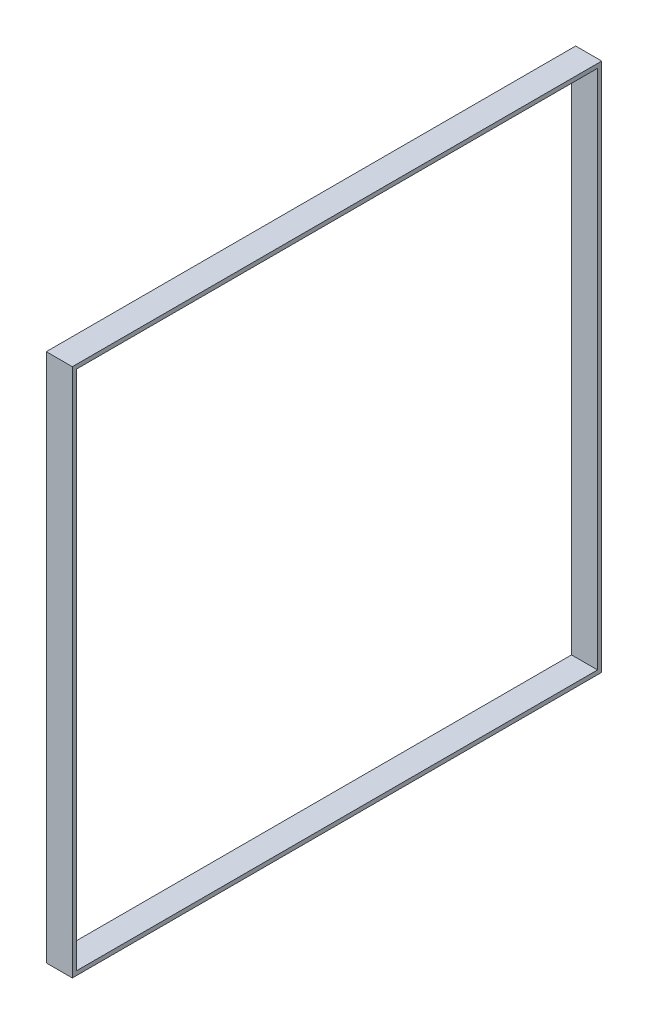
ISO-10303-21;
HEADER;
FILE_DESCRIPTION(('STEP AP214'),'2;1');
FILE_NAME('part.step','',(''),(''),'','','');
FILE_SCHEMA(('AUTOMOTIVE_DESIGN { 1 0 10303 214 1 1 1 1 }'));
ENDSEC;
DATA;
#1=APPLICATION_CONTEXT('core data for automotive mechanical design processes');
#2=APPLICATION_PROTOCOL_DEFINITION('international standard','automotive_design',2000,#1);
#3=PRODUCT_CONTEXT('',#1,'mechanical');
#4=PRODUCT('Part','Part','',(#3));
#5=PRODUCT_RELATED_PRODUCT_CATEGORY('part','',(#4));
#6=PRODUCT_DEFINITION_FORMATION('','',#4);
#7=PRODUCT_DEFINITION_CONTEXT('part definition',#1,'design');
#8=PRODUCT_DEFINITION('design','',#6,#7);
#9=PRODUCT_DEFINITION_SHAPE('','',#8);
#10=(LENGTH_UNIT() NAMED_UNIT(*) SI_UNIT(.MILLI.,.METRE.));
#11=(NAMED_UNIT(*) PLANE_ANGLE_UNIT() SI_UNIT($,.RADIAN.));
#12=(NAMED_UNIT(*) SI_UNIT($,.STERADIAN.) SOLID_ANGLE_UNIT());
#13=UNCERTAINTY_MEASURE_WITH_UNIT(LENGTH_MEASURE(1.E-05),#10,'distance_accuracy_value','');
#14=(GEOMETRIC_REPRESENTATION_CONTEXT(3) GLOBAL_UNCERTAINTY_ASSIGNED_CONTEXT((#13)) GLOBAL_UNIT_ASSIGNED_CONTEXT((#10,
#11,#12)) REPRESENTATION_CONTEXT('',''));
#15=CARTESIAN_POINT('',(0.,0.,0.));
#16=DIRECTION('',(0.,0.,1.));
#17=DIRECTION('',(1.,0.,0.));
#18=AXIS2_PLACEMENT_3D('',#15,#16,#17);
#19=CARTESIAN_POINT('',(15.,0.,0.));
#20=DIRECTION('',(1.,0.,0.));
#21=DIRECTION('',(0.,0.,-1.));
#22=AXIS2_PLACEMENT_3D('',#19,#20,#21);
#23=PLANE('',#22);
#24=DIRECTION('',(0.,0.,-1.));
#25=VECTOR('',#24,1.);
#26=CARTESIAN_POINT('',(15.,-152.4,152.4));
#27=LINE('',#26,#25);
#28=CARTESIAN_POINT('',(15.,-152.4,152.4));
#29=VERTEX_POINT('',#28);
#30=CARTESIAN_POINT('',(15.,-152.4,-152.4));
#31=VERTEX_POINT('',#30);
#32=EDGE_CURVE('E156',#29,#31,#27,.T.);
#33=ORIENTED_EDGE('',*,*,#32,.T.);
#34=DIRECTION('',(0.,1.,0.));
#35=VECTOR('',#34,1.);
#36=CARTESIAN_POINT('',(15.,-152.4,-152.4));
#37=LINE('',#36,#35);
#38=CARTESIAN_POINT('',(15.,152.4,-152.4));
#39=VERTEX_POINT('',#38);
#40=EDGE_CURVE('E164',#31,#39,#37,.T.);
#41=ORIENTED_EDGE('',*,*,#40,.T.);
#42=DIRECTION('',(0.,0.,1.));
#43=VECTOR('',#42,1.);
#44=CARTESIAN_POINT('',(15.,152.4,-152.4));
#45=LINE('',#44,#43);
#46=CARTESIAN_POINT('',(15.,152.4,152.4));
#47=VERTEX_POINT('',#46);
#48=EDGE_CURVE('E168',#39,#47,#45,.T.);
#49=ORIENTED_EDGE('',*,*,#48,.T.);
#50=DIRECTION('',(0.,-1.,0.));
#51=VECTOR('',#50,1.);
#52=CARTESIAN_POINT('',(15.,152.4,152.4));
#53=LINE('',#52,#51);
#54=EDGE_CURVE('E170',#47,#29,#53,.T.);
#55=ORIENTED_EDGE('',*,*,#54,.T.);
#56=EDGE_LOOP('',(#33,#41,#49,#55));
#57=FACE_BOUND('',#56,.T.);
#58=DIRECTION('',(0.,1.,0.));
#59=VECTOR('',#58,1.);
#60=CARTESIAN_POINT('',(15.,-150.,-150.));
#61=LINE('',#60,#59);
#62=CARTESIAN_POINT('',(15.,-150.,-150.));
#63=VERTEX_POINT('',#62);
#64=CARTESIAN_POINT('',(15.,150.,-150.));
#65=VERTEX_POINT('',#64);
#66=EDGE_CURVE('E120',#63,#65,#61,.T.);
#67=ORIENTED_EDGE('',*,*,#66,.F.);
#68=DIRECTION('',(0.,0.,-1.));
#69=VECTOR('',#68,1.);
#70=CARTESIAN_POINT('',(15.,-150.,150.));
#71=LINE('',#70,#69);
#72=CARTESIAN_POINT('',(15.,-150.,150.));
#73=VERTEX_POINT('',#72);
#74=EDGE_CURVE('E107',#73,#63,#71,.T.);
#75=ORIENTED_EDGE('',*,*,#74,.F.);
#76=DIRECTION('',(0.,-1.,0.));
#77=VECTOR('',#76,1.);
#78=CARTESIAN_POINT('',(15.,150.,150.));
#79=LINE('',#78,#77);
#80=CARTESIAN_POINT('',(15.,150.,150.));
#81=VERTEX_POINT('',#80);
#82=EDGE_CURVE('E136',#81,#73,#79,.T.);
#83=ORIENTED_EDGE('',*,*,#82,.F.);
#84=DIRECTION('',(0.,0.,1.));
#85=VECTOR('',#84,1.);
#86=CARTESIAN_POINT('',(15.,150.,-150.));
#87=LINE('',#86,#85);
#88=EDGE_CURVE('E131',#65,#81,#87,.T.);
#89=ORIENTED_EDGE('',*,*,#88,.F.);
#90=EDGE_LOOP('',(#67,#75,#83,#89));
#91=FACE_BOUND('',#90,.T.);
#92=ADVANCED_FACE('F43',(#57,#91),#23,.T.);
#93=CARTESIAN_POINT('',(0.,0.,0.));
#94=DIRECTION('',(1.,0.,0.));
#95=DIRECTION('',(0.,0.,-1.));
#96=AXIS2_PLACEMENT_3D('',#93,#94,#95);
#97=PLANE('',#96);
#98=DIRECTION('',(0.,0.,-1.));
#99=VECTOR('',#98,1.);
#100=CARTESIAN_POINT('',(0.,-152.4,152.4));
#101=LINE('',#100,#99);
#102=CARTESIAN_POINT('',(0.,-152.4,152.4));
#103=VERTEX_POINT('',#102);
#104=CARTESIAN_POINT('',(0.,-152.4,-152.4));
#105=VERTEX_POINT('',#104);
#106=EDGE_CURVE('E130',#103,#105,#101,.T.);
#107=ORIENTED_EDGE('',*,*,#106,.F.);
#108=DIRECTION('',(0.,-1.,0.));
#109=VECTOR('',#108,1.);
#110=CARTESIAN_POINT('',(0.,152.4,152.4));
#111=LINE('',#110,#109);
#112=CARTESIAN_POINT('',(0.,152.4,152.4));
#113=VERTEX_POINT('',#112);
#114=EDGE_CURVE('E165',#113,#103,#111,.T.);
#115=ORIENTED_EDGE('',*,*,#114,.F.);
#116=DIRECTION('',(0.,0.,1.));
#117=VECTOR('',#116,1.);
#118=CARTESIAN_POINT('',(0.,152.4,-152.4));
#119=LINE('',#118,#117);
#120=CARTESIAN_POINT('',(0.,152.4,-152.4));
#121=VERTEX_POINT('',#120);
#122=EDGE_CURVE('E177',#121,#113,#119,.T.);
#123=ORIENTED_EDGE('',*,*,#122,.F.);
#124=DIRECTION('',(0.,1.,0.));
#125=VECTOR('',#124,1.);
#126=CARTESIAN_POINT('',(0.,-152.4,-152.4));
#127=LINE('',#126,#125);
#128=EDGE_CURVE('E176',#105,#121,#127,.T.);
#129=ORIENTED_EDGE('',*,*,#128,.F.);
#130=EDGE_LOOP('',(#107,#115,#123,#129));
#131=FACE_BOUND('',#130,.T.);
#132=DIRECTION('',(0.,0.,-1.));
#133=VECTOR('',#132,1.);
#134=CARTESIAN_POINT('',(0.,-150.,150.));
#135=LINE('',#134,#133);
#136=CARTESIAN_POINT('',(0.,-150.,150.));
#137=VERTEX_POINT('',#136);
#138=CARTESIAN_POINT('',(0.,-150.,-150.));
#139=VERTEX_POINT('',#138);
#140=EDGE_CURVE('E70',#137,#139,#135,.T.);
#141=ORIENTED_EDGE('',*,*,#140,.T.);
#142=DIRECTION('',(0.,1.,0.));
#143=VECTOR('',#142,1.);
#144=CARTESIAN_POINT('',(0.,-150.,-150.));
#145=LINE('',#144,#143);
#146=CARTESIAN_POINT('',(0.,150.,-150.));
#147=VERTEX_POINT('',#146);
#148=EDGE_CURVE('E124',#139,#147,#145,.T.);
#149=ORIENTED_EDGE('',*,*,#148,.T.);
#150=DIRECTION('',(0.,0.,1.));
#151=VECTOR('',#150,1.);
#152=CARTESIAN_POINT('',(0.,150.,-150.));
#153=LINE('',#152,#151);
#154=CARTESIAN_POINT('',(0.,150.,150.));
#155=VERTEX_POINT('',#154);
#156=EDGE_CURVE('E144',#147,#155,#153,.T.);
#157=ORIENTED_EDGE('',*,*,#156,.T.);
#158=DIRECTION('',(0.,-1.,0.));
#159=VECTOR('',#158,1.);
#160=CARTESIAN_POINT('',(0.,150.,150.));
#161=LINE('',#160,#159);
#162=EDGE_CURVE('E116',#155,#137,#161,.T.);
#163=ORIENTED_EDGE('',*,*,#162,.T.);
#164=EDGE_LOOP('',(#141,#149,#157,#163));
#165=FACE_BOUND('',#164,.T.);
#166=ADVANCED_FACE('F201',(#131,#165),#97,.F.);
#167=CARTESIAN_POINT('',(15.,-152.4,152.4));
#168=DIRECTION('',(0.,1.,0.));
#169=DIRECTION('',(0.,0.,1.));
#170=AXIS2_PLACEMENT_3D('',#167,#168,#169);
#171=PLANE('',#170);
#172=ORIENTED_EDGE('',*,*,#106,.T.);
#173=DIRECTION('',(-1.,0.,0.));
#174=VECTOR('',#173,1.);
#175=CARTESIAN_POINT('',(15.,-152.4,-152.4));
#176=LINE('',#175,#174);
#177=EDGE_CURVE('E11',#31,#105,#176,.T.);
#178=ORIENTED_EDGE('',*,*,#177,.F.);
#179=ORIENTED_EDGE('',*,*,#32,.F.);
#180=DIRECTION('',(-1.,0.,0.));
#181=VECTOR('',#180,1.);
#182=CARTESIAN_POINT('',(15.,-152.4,152.4));
#183=LINE('',#182,#181);
#184=EDGE_CURVE('E175',#29,#103,#183,.T.);
#185=ORIENTED_EDGE('',*,*,#184,.T.);
#186=EDGE_LOOP('',(#172,#178,#179,#185));
#187=FACE_BOUND('',#186,.T.);
#188=ADVANCED_FACE('F44',(#187),#171,.F.);
#189=CARTESIAN_POINT('',(15.,-152.4,-152.4));
#190=DIRECTION('',(0.,0.,1.));
#191=DIRECTION('',(1.,0.,0.));
#192=AXIS2_PLACEMENT_3D('',#189,#190,#191);
#193=PLANE('',#192);
#194=ORIENTED_EDGE('',*,*,#128,.T.);
#195=DIRECTION('',(-1.,0.,0.));
#196=VECTOR('',#195,1.);
#197=CARTESIAN_POINT('',(15.,152.4,-152.4));
#198=LINE('',#197,#196);
#199=EDGE_CURVE('E55',#39,#121,#198,.T.);
#200=ORIENTED_EDGE('',*,*,#199,.F.);
#201=ORIENTED_EDGE('',*,*,#40,.F.);
#202=ORIENTED_EDGE('',*,*,#177,.T.);
#203=EDGE_LOOP('',(#194,#200,#201,#202));
#204=FACE_BOUND('',#203,.T.);
#205=ADVANCED_FACE('F211',(#204),#193,.F.);
#206=CARTESIAN_POINT('',(15.,152.4,-152.4));
#207=DIRECTION('',(0.,-1.,0.));
#208=DIRECTION('',(0.,0.,-1.));
#209=AXIS2_PLACEMENT_3D('',#206,#207,#208);
#210=PLANE('',#209);
#211=ORIENTED_EDGE('',*,*,#122,.T.);
#212=DIRECTION('',(-1.,0.,0.));
#213=VECTOR('',#212,1.);
#214=CARTESIAN_POINT('',(15.,152.4,152.4));
#215=LINE('',#214,#213);
#216=EDGE_CURVE('E190',#47,#113,#215,.T.);
#217=ORIENTED_EDGE('',*,*,#216,.F.);
#218=ORIENTED_EDGE('',*,*,#48,.F.);
#219=ORIENTED_EDGE('',*,*,#199,.T.);
#220=EDGE_LOOP('',(#211,#217,#218,#219));
#221=FACE_BOUND('',#220,.T.);
#222=ADVANCED_FACE('F200',(#221),#210,.F.);
#223=CARTESIAN_POINT('',(15.,152.4,152.4));
#224=DIRECTION('',(0.,0.,-1.));
#225=DIRECTION('',(-1.,0.,0.));
#226=AXIS2_PLACEMENT_3D('',#223,#224,#225);
#227=PLANE('',#226);
#228=ORIENTED_EDGE('',*,*,#114,.T.);
#229=ORIENTED_EDGE('',*,*,#184,.F.);
#230=ORIENTED_EDGE('',*,*,#54,.F.);
#231=ORIENTED_EDGE('',*,*,#216,.T.);
#232=EDGE_LOOP('',(#228,#229,#230,#231));
#233=FACE_BOUND('',#232,.T.);
#234=ADVANCED_FACE('F209',(#233),#227,.F.);
#235=CARTESIAN_POINT('',(15.,-150.,150.));
#236=DIRECTION('',(0.,1.,0.));
#237=DIRECTION('',(0.,0.,1.));
#238=AXIS2_PLACEMENT_3D('',#235,#236,#237);
#239=PLANE('',#238);
#240=ORIENTED_EDGE('',*,*,#140,.F.);
#241=DIRECTION('',(-1.,0.,0.));
#242=VECTOR('',#241,1.);
#243=CARTESIAN_POINT('',(15.,-150.,150.));
#244=LINE('',#243,#242);
#245=EDGE_CURVE('E111',#73,#137,#244,.T.);
#246=ORIENTED_EDGE('',*,*,#245,.F.);
#247=ORIENTED_EDGE('',*,*,#74,.T.);
#248=DIRECTION('',(-1.,0.,0.));
#249=VECTOR('',#248,1.);
#250=CARTESIAN_POINT('',(15.,-150.,-150.));
#251=LINE('',#250,#249);
#252=EDGE_CURVE('E115',#63,#139,#251,.T.);
#253=ORIENTED_EDGE('',*,*,#252,.T.);
#254=EDGE_LOOP('',(#240,#246,#247,#253));
#255=FACE_BOUND('',#254,.T.);
#256=ADVANCED_FACE('F112',(#255),#239,.T.);
#257=CARTESIAN_POINT('',(15.,-150.,-150.));
#258=DIRECTION('',(0.,0.,1.));
#259=DIRECTION('',(1.,0.,0.));
#260=AXIS2_PLACEMENT_3D('',#257,#258,#259);
#261=PLANE('',#260);
#262=ORIENTED_EDGE('',*,*,#148,.F.);
#263=ORIENTED_EDGE('',*,*,#252,.F.);
#264=ORIENTED_EDGE('',*,*,#66,.T.);
#265=DIRECTION('',(-1.,0.,0.));
#266=VECTOR('',#265,1.);
#267=CARTESIAN_POINT('',(15.,150.,-150.));
#268=LINE('',#267,#266);
#269=EDGE_CURVE('E126',#65,#147,#268,.T.);
#270=ORIENTED_EDGE('',*,*,#269,.T.);
#271=EDGE_LOOP('',(#262,#263,#264,#270));
#272=FACE_BOUND('',#271,.T.);
#273=ADVANCED_FACE('F122',(#272),#261,.T.);
#274=CARTESIAN_POINT('',(15.,150.,-150.));
#275=DIRECTION('',(0.,-1.,0.));
#276=DIRECTION('',(0.,0.,-1.));
#277=AXIS2_PLACEMENT_3D('',#274,#275,#276);
#278=PLANE('',#277);
#279=ORIENTED_EDGE('',*,*,#156,.F.);
#280=ORIENTED_EDGE('',*,*,#269,.F.);
#281=ORIENTED_EDGE('',*,*,#88,.T.);
#282=DIRECTION('',(-1.,0.,0.));
#283=VECTOR('',#282,1.);
#284=CARTESIAN_POINT('',(15.,150.,150.));
#285=LINE('',#284,#283);
#286=EDGE_CURVE('E56',#81,#155,#285,.T.);
#287=ORIENTED_EDGE('',*,*,#286,.T.);
#288=EDGE_LOOP('',(#279,#280,#281,#287));
#289=FACE_BOUND('',#288,.T.);
#290=ADVANCED_FACE('F238',(#289),#278,.T.);
#291=CARTESIAN_POINT('',(15.,150.,150.));
#292=DIRECTION('',(0.,0.,-1.));
#293=DIRECTION('',(-1.,0.,0.));
#294=AXIS2_PLACEMENT_3D('',#291,#292,#293);
#295=PLANE('',#294);
#296=ORIENTED_EDGE('',*,*,#162,.F.);
#297=ORIENTED_EDGE('',*,*,#286,.F.);
#298=ORIENTED_EDGE('',*,*,#82,.T.);
#299=ORIENTED_EDGE('',*,*,#245,.T.);
#300=EDGE_LOOP('',(#296,#297,#298,#299));
#301=FACE_BOUND('',#300,.T.);
#302=ADVANCED_FACE('F244',(#301),#295,.T.);
#303=CLOSED_SHELL('',(#92,#166,#188,#205,#222,#234,#256,#273,#290,#302));
#304=MANIFOLD_SOLID_BREP('B2',#303);
#305=ADVANCED_BREP_SHAPE_REPRESENTATION('',(#18,#304),#14);
#306=SHAPE_DEFINITION_REPRESENTATION(#9,#305);
ENDSEC;
END-ISO-10303-21;
